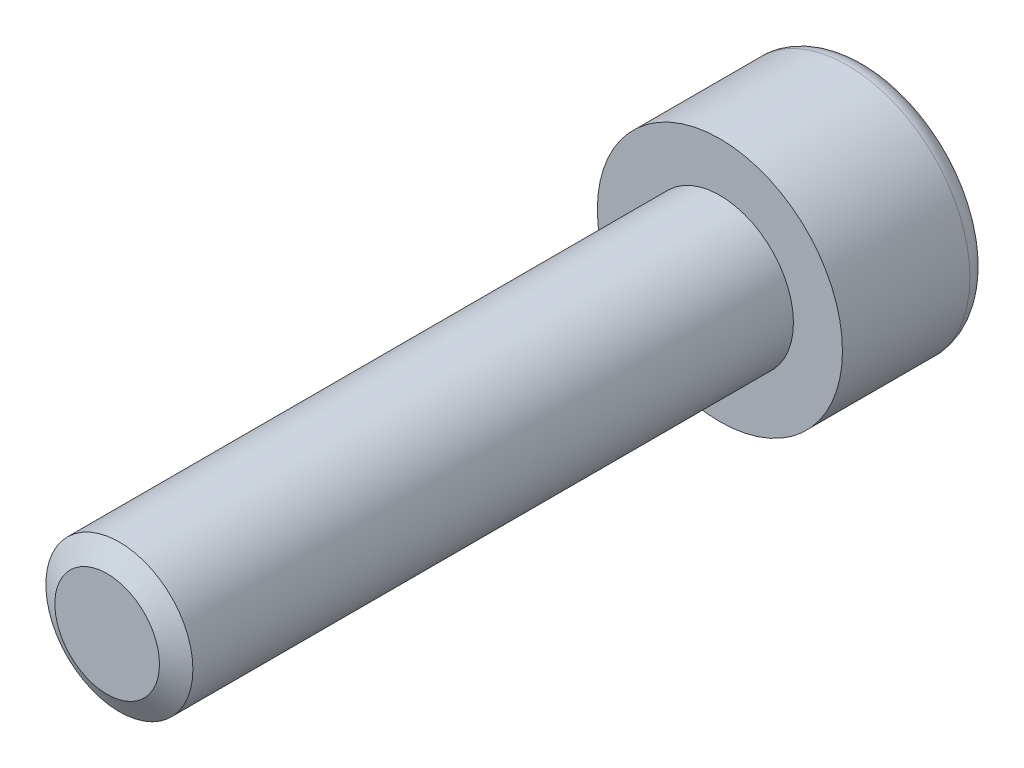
ISO-10303-21;
HEADER;
FILE_DESCRIPTION(('STEP AP214'),'2;1');
FILE_NAME('part.step','',(''),(''),'','','');
FILE_SCHEMA(('AUTOMOTIVE_DESIGN { 1 0 10303 214 1 1 1 1 }'));
ENDSEC;
DATA;
#1=APPLICATION_CONTEXT('core data for automotive mechanical design processes');
#2=APPLICATION_PROTOCOL_DEFINITION('international standard','automotive_design',2000,#1);
#3=PRODUCT_CONTEXT('',#1,'mechanical');
#4=PRODUCT('Part','Part','',(#3));
#5=PRODUCT_RELATED_PRODUCT_CATEGORY('part','',(#4));
#6=PRODUCT_DEFINITION_FORMATION('','',#4);
#7=PRODUCT_DEFINITION_CONTEXT('part definition',#1,'design');
#8=PRODUCT_DEFINITION('design','',#6,#7);
#9=PRODUCT_DEFINITION_SHAPE('','',#8);
#10=(LENGTH_UNIT() NAMED_UNIT(*) SI_UNIT(.MILLI.,.METRE.));
#11=(NAMED_UNIT(*) PLANE_ANGLE_UNIT() SI_UNIT($,.RADIAN.));
#12=(NAMED_UNIT(*) SI_UNIT($,.STERADIAN.) SOLID_ANGLE_UNIT());
#13=UNCERTAINTY_MEASURE_WITH_UNIT(LENGTH_MEASURE(1.E-05),#10,'distance_accuracy_value','');
#14=(GEOMETRIC_REPRESENTATION_CONTEXT(3) GLOBAL_UNCERTAINTY_ASSIGNED_CONTEXT((#13)) GLOBAL_UNIT_ASSIGNED_CONTEXT((#10,
#11,#12)) REPRESENTATION_CONTEXT('',''));
#15=CARTESIAN_POINT('',(0.,0.,0.));
#16=DIRECTION('',(0.,0.,1.));
#17=DIRECTION('',(1.,0.,0.));
#18=AXIS2_PLACEMENT_3D('',#15,#16,#17);
#19=CARTESIAN_POINT('',(0.,0.,-6.));
#20=DIRECTION('',(0.,0.,-1.));
#21=DIRECTION('',(-1.,0.,0.));
#22=AXIS2_PLACEMENT_3D('',#19,#20,#21);
#23=PLANE('',#22);
#24=CARTESIAN_POINT('',(0.,0.,-6.));
#25=DIRECTION('',(0.,0.,-1.));
#26=DIRECTION('',(-1.,0.,0.));
#27=AXIS2_PLACEMENT_3D('',#24,#25,#26);
#28=CIRCLE('',#27,4.2);
#29=CARTESIAN_POINT('',(-4.2,0.,-6.));
#30=VERTEX_POINT('',#29);
#31=EDGE_CURVE('E32',#30,#30,#28,.T.);
#32=ORIENTED_EDGE('',*,*,#31,.T.);
#33=EDGE_LOOP('',(#32));
#34=FACE_BOUND('',#33,.T.);
#35=CARTESIAN_POINT('',(0.,0.,-6.));
#36=DIRECTION('',(0.,0.,1.));
#37=DIRECTION('',(1.,0.,0.));
#38=AXIS2_PLACEMENT_3D('',#35,#36,#37);
#39=CIRCLE('',#38,2.88675134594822);
#40=CARTESIAN_POINT('',(-1.44337567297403,2.50000000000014,-6.));
#41=VERTEX_POINT('',#40);
#42=CARTESIAN_POINT('',(-2.88675134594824,0.,-6.));
#43=VERTEX_POINT('',#42);
#44=EDGE_CURVE('E45',#41,#43,#39,.T.);
#45=ORIENTED_EDGE('',*,*,#44,.T.);
#46=CARTESIAN_POINT('',(-1.44337567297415,-2.50000000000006,-6.));
#47=VERTEX_POINT('',#46);
#48=EDGE_CURVE('E122',#43,#47,#39,.T.);
#49=ORIENTED_EDGE('',*,*,#48,.T.);
#50=CARTESIAN_POINT('',(1.44337567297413,-2.50000000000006,-6.));
#51=VERTEX_POINT('',#50);
#52=EDGE_CURVE('E121',#47,#51,#39,.T.);
#53=ORIENTED_EDGE('',*,*,#52,.T.);
#54=CARTESIAN_POINT('',(2.88675134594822,0.,-6.));
#55=VERTEX_POINT('',#54);
#56=EDGE_CURVE('E90',#51,#55,#39,.T.);
#57=ORIENTED_EDGE('',*,*,#56,.T.);
#58=CARTESIAN_POINT('',(1.44337567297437,2.49999999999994,-6.));
#59=VERTEX_POINT('',#58);
#60=EDGE_CURVE('E80',#55,#59,#39,.T.);
#61=ORIENTED_EDGE('',*,*,#60,.T.);
#62=EDGE_CURVE('E38',#59,#41,#39,.T.);
#63=ORIENTED_EDGE('',*,*,#62,.T.);
#64=EDGE_LOOP('',(#45,#49,#53,#57,#61,#63));
#65=FACE_BOUND('',#64,.T.);
#66=ADVANCED_FACE('F24',(#34,#65),#23,.T.);
#67=CARTESIAN_POINT('',(0.,0.,25.));
#68=DIRECTION('',(0.,0.,-1.));
#69=DIRECTION('',(-1.,0.,0.));
#70=AXIS2_PLACEMENT_3D('',#67,#68,#69);
#71=CYLINDRICAL_SURFACE('',#70,3.);
#72=CARTESIAN_POINT('',(0.,0.,24.5));
#73=DIRECTION('',(0.,0.,1.));
#74=DIRECTION('',(1.,0.,0.));
#75=AXIS2_PLACEMENT_3D('',#72,#73,#74);
#76=CIRCLE('',#75,3.);
#77=CARTESIAN_POINT('',(2.99999999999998,0.,24.5));
#78=VERTEX_POINT('',#77);
#79=EDGE_CURVE('E100',#78,#78,#76,.F.);
#80=ORIENTED_EDGE('',*,*,#79,.T.);
#81=EDGE_LOOP('',(#80));
#82=FACE_BOUND('',#81,.T.);
#83=CARTESIAN_POINT('',(0.,0.,0.));
#84=DIRECTION('',(0.,0.,1.));
#85=DIRECTION('',(1.,0.,0.));
#86=AXIS2_PLACEMENT_3D('',#83,#84,#85);
#87=CIRCLE('',#86,3.);
#88=CARTESIAN_POINT('',(3.,0.,0.));
#89=VERTEX_POINT('',#88);
#90=EDGE_CURVE('E218',#89,#89,#87,.T.);
#91=ORIENTED_EDGE('',*,*,#90,.T.);
#92=EDGE_LOOP('',(#91));
#93=FACE_BOUND('',#92,.T.);
#94=ADVANCED_FACE('F26',(#82,#93),#71,.T.);
#95=CARTESIAN_POINT('',(0.,0.,25.));
#96=DIRECTION('',(0.,0.,1.));
#97=DIRECTION('',(1.,0.,0.));
#98=AXIS2_PLACEMENT_3D('',#95,#96,#97);
#99=PLANE('',#98);
#100=CARTESIAN_POINT('',(0.,0.,25.));
#101=DIRECTION('',(0.,0.,1.));
#102=DIRECTION('',(1.,0.,0.));
#103=AXIS2_PLACEMENT_3D('',#100,#101,#102);
#104=CIRCLE('',#103,2.13397459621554);
#105=CARTESIAN_POINT('',(2.13397459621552,0.,25.));
#106=VERTEX_POINT('',#105);
#107=EDGE_CURVE('E216',#106,#106,#104,.T.);
#108=ORIENTED_EDGE('',*,*,#107,.T.);
#109=EDGE_LOOP('',(#108));
#110=FACE_BOUND('',#109,.T.);
#111=ADVANCED_FACE('F197',(#110),#99,.T.);
#112=CARTESIAN_POINT('',(0.,0.,25.));
#113=DIRECTION('',(0.,0.,-1.));
#114=DIRECTION('',(-1.,0.,0.));
#115=AXIS2_PLACEMENT_3D('',#112,#113,#114);
#116=CONICAL_SURFACE('',#115,2.13397459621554,1.0471975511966);
#117=ORIENTED_EDGE('',*,*,#79,.F.);
#118=EDGE_LOOP('',(#117));
#119=FACE_BOUND('',#118,.T.);
#120=ORIENTED_EDGE('',*,*,#107,.F.);
#121=EDGE_LOOP('',(#120));
#122=FACE_BOUND('',#121,.T.);
#123=ADVANCED_FACE('F206',(#119,#122),#116,.T.);
#124=CARTESIAN_POINT('',(0.,0.,-6.));
#125=DIRECTION('',(0.,0.,1.));
#126=DIRECTION('',(1.,0.,0.));
#127=AXIS2_PLACEMENT_3D('',#124,#125,#126);
#128=CYLINDRICAL_SURFACE('',#127,5.);
#129=CARTESIAN_POINT('',(0.,0.,-5.2));
#130=DIRECTION('',(0.,0.,-1.));
#131=DIRECTION('',(-1.,0.,0.));
#132=AXIS2_PLACEMENT_3D('',#129,#130,#131);
#133=CIRCLE('',#132,5.);
#134=CARTESIAN_POINT('',(-5.,0.,-5.2));
#135=VERTEX_POINT('',#134);
#136=EDGE_CURVE('E11',#135,#135,#133,.F.);
#137=ORIENTED_EDGE('',*,*,#136,.T.);
#138=EDGE_LOOP('',(#137));
#139=FACE_BOUND('',#138,.T.);
#140=CARTESIAN_POINT('',(0.,0.,0.));
#141=DIRECTION('',(0.,0.,-1.));
#142=DIRECTION('',(-1.,0.,0.));
#143=AXIS2_PLACEMENT_3D('',#140,#141,#142);
#144=CIRCLE('',#143,5.);
#145=CARTESIAN_POINT('',(-5.,0.,0.));
#146=VERTEX_POINT('',#145);
#147=EDGE_CURVE('E222',#146,#146,#144,.T.);
#148=ORIENTED_EDGE('',*,*,#147,.T.);
#149=EDGE_LOOP('',(#148));
#150=FACE_BOUND('',#149,.T.);
#151=ADVANCED_FACE('F203',(#139,#150),#128,.T.);
#152=CARTESIAN_POINT('',(0.,0.,0.));
#153=DIRECTION('',(0.,0.,-1.));
#154=DIRECTION('',(-1.,0.,0.));
#155=AXIS2_PLACEMENT_3D('',#152,#153,#154);
#156=PLANE('',#155);
#157=ORIENTED_EDGE('',*,*,#90,.F.);
#158=EDGE_LOOP('',(#157));
#159=FACE_BOUND('',#158,.T.);
#160=ORIENTED_EDGE('',*,*,#147,.F.);
#161=EDGE_LOOP('',(#160));
#162=FACE_BOUND('',#161,.T.);
#163=ADVANCED_FACE('F202',(#159,#162),#156,.F.);
#164=CARTESIAN_POINT('',(0.,0.,-6.));
#165=DIRECTION('',(0.,0.,-1.));
#166=DIRECTION('',(-1.,0.,0.));
#167=AXIS2_PLACEMENT_3D('',#164,#165,#166);
#168=CONICAL_SURFACE('',#167,2.88675134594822,1.23732315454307);
#169=CARTESIAN_POINT('',(1.44326020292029,-2.50020000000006,-6.0000400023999));
#170=CARTESIAN_POINT('',(1.50307703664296,-2.3965942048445,-5.97930932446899));
#171=CARTESIAN_POINT('',(1.56307309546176,-2.29267798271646,-5.9604588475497));
#172=CARTESIAN_POINT('',(1.68341879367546,-2.08423311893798,-5.92730365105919));
#173=CARTESIAN_POINT('',(1.74376865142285,-1.97970409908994,-5.91300212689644));
#174=CARTESIAN_POINT('',(1.86421417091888,-1.77108633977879,-5.8898611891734));
#175=CARTESIAN_POINT('',(1.92430757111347,-1.66700151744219,-5.88097596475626));
#176=CARTESIAN_POINT('',(2.04462185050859,-1.4586110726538,-5.86905905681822));
#177=CARTESIAN_POINT('',(2.10484267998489,-1.35430553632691,-5.86602540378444));
#178=CARTESIAN_POINT('',(2.22528433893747,-1.14569446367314,-5.86602540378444));
#179=CARTESIAN_POINT('',(2.28550516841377,-1.04138892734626,-5.86905905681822));
#180=CARTESIAN_POINT('',(2.40581944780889,-0.832998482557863,-5.88097596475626));
#181=CARTESIAN_POINT('',(2.46591284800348,-0.728913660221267,-5.8898611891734));
#182=CARTESIAN_POINT('',(2.58635836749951,-0.520295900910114,-5.91300212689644));
#183=CARTESIAN_POINT('',(2.6467082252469,-0.415766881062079,-5.92730365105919));
#184=CARTESIAN_POINT('',(2.7670539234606,-0.207322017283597,-5.9604588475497));
#185=CARTESIAN_POINT('',(2.82704998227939,-0.103405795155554,-5.97930932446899));
#186=CARTESIAN_POINT('',(2.88686681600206,0.00020000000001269,-6.0000400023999));
#187=B_SPLINE_CURVE_WITH_KNOTS('',3,(#169,#170,#171,#172,#173,#174,#175,#176,#177,#178,#179,
#180,#181,#182,#183,#184,#185,#186),.UNSPECIFIED.,.F.,.F.,(4,2,2,2,2,2,2,2,4),(0.,
0.364283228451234,0.728821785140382,1.09023268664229,1.45152192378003,1.81281116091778,
2.17422206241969,2.53876061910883,2.90304384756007),.UNSPECIFIED.);
#188=EDGE_CURVE('E94',#51,#55,#187,.T.);
#189=ORIENTED_EDGE('',*,*,#188,.T.);
#190=ORIENTED_EDGE('',*,*,#56,.F.);
#191=EDGE_LOOP('',(#189,#190));
#192=FACE_BOUND('',#191,.T.);
#193=ADVANCED_FACE('F95',(#192),#168,.F.);
#194=CARTESIAN_POINT('',(-3.74214401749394,-2.50000000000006,-6.55898589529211));
#195=CARTESIAN_POINT('',(-3.62969526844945,-2.50000000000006,-6.52660458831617));
#196=CARTESIAN_POINT('',(-3.51712953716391,-2.50000000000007,-6.49462272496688));
#197=CARTESIAN_POINT('',(-3.29170495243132,-2.50000000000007,-6.43167651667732));
#198=CARTESIAN_POINT('',(-3.17884607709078,-2.50000000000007,-6.40071225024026));
#199=CARTESIAN_POINT('',(-2.95258941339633,-2.50000000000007,-6.33997017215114));
#200=CARTESIAN_POINT('',(-2.83919102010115,-2.50000000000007,-6.31019460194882));
#201=CARTESIAN_POINT('',(-2.61199972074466,-2.50000000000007,-6.25219835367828));
#202=CARTESIAN_POINT('',(-2.49820682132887,-2.50000000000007,-6.22397764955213));
#203=CARTESIAN_POINT('',(-2.15931860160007,-2.50000000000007,-6.14294166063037));
#204=CARTESIAN_POINT('',(-1.93355036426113,-2.50000000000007,-6.0928838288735));
#205=CARTESIAN_POINT('',(-1.47974581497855,-2.50000000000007,-6.00427398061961));
#206=CARTESIAN_POINT('',(-1.25171048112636,-2.50000000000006,-5.9657172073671));
#207=CARTESIAN_POINT('',(-0.915512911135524,-2.50000000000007,-5.92163126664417));
#208=CARTESIAN_POINT('',(-0.80822425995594,-2.50000000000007,-5.90945086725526));
#209=CARTESIAN_POINT('',(-0.593253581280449,-2.50000000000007,-5.88935340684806));
#210=CARTESIAN_POINT('',(-0.485571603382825,-2.50000000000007,-5.88143582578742));
#211=CARTESIAN_POINT('',(-0.270027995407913,-2.50000000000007,-5.87028095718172));
#212=CARTESIAN_POINT('',(-0.162166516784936,-2.50000000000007,-5.86704079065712));
#213=CARTESIAN_POINT('',(0.0535937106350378,-2.50000000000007,-5.86541831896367));
#214=CARTESIAN_POINT('',(0.161492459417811,-2.50000000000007,-5.86703601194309));
#215=CARTESIAN_POINT('',(0.37778532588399,-2.50000000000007,-5.87505996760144));
#216=CARTESIAN_POINT('',(0.486178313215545,-2.50000000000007,-5.88149616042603));
#217=CARTESIAN_POINT('',(0.702607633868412,-2.50000000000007,-5.89883679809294));
#218=CARTESIAN_POINT('',(0.810643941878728,-2.50000000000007,-5.90974155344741));
#219=CARTESIAN_POINT('',(1.02633546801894,-2.50000000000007,-5.93550617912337));
#220=CARTESIAN_POINT('',(1.13399025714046,-2.50000000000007,-5.95036959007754));
#221=CARTESIAN_POINT('',(1.34877490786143,-2.50000000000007,-5.98345944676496));
#222=CARTESIAN_POINT('',(1.45590477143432,-2.50000000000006,-6.0016858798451));
#223=CARTESIAN_POINT('',(1.68753741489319,-2.50000000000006,-6.04421721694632));
#224=CARTESIAN_POINT('',(1.81194646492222,-2.50000000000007,-6.06902890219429));
#225=CARTESIAN_POINT('',(2.06012776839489,-2.50000000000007,-6.12166849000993));
#226=CARTESIAN_POINT('',(2.18389997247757,-2.50000000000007,-6.14949662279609));
#227=CARTESIAN_POINT('',(2.43091931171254,-2.50000000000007,-6.20753261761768));
#228=CARTESIAN_POINT('',(2.55416628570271,-2.50000000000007,-6.23774116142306));
#229=CARTESIAN_POINT('',(2.80018730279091,-2.50000000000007,-6.30003193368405));
#230=CARTESIAN_POINT('',(2.9229613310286,-2.50000000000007,-6.3321142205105));
#231=CARTESIAN_POINT('',(3.29092574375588,-2.50000000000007,-6.43062684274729));
#232=CARTESIAN_POINT('',(3.53552350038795,-2.50000000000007,-6.49926603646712));
#233=CARTESIAN_POINT('',(4.02363195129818,-2.50000000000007,-6.64030395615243));
#234=CARTESIAN_POINT('',(4.26714259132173,-2.50000000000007,-6.71270286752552));
#235=CARTESIAN_POINT('',(4.74885074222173,-2.50000000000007,-6.85865200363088));
#236=CARTESIAN_POINT('',(4.98706247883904,-2.50000000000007,-6.93215540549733));
#237=CARTESIAN_POINT('',(5.46296455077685,-2.50000000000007,-7.08086936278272));
#238=CARTESIAN_POINT('',(5.70065485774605,-2.50000000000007,-7.15608000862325));
#239=CARTESIAN_POINT('',(6.17486752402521,-2.50000000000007,-7.30747953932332));
#240=CARTESIAN_POINT('',(6.41139116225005,-2.50000000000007,-7.38366442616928));
#241=CARTESIAN_POINT('',(6.88412079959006,-2.50000000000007,-7.53695307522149));
#242=CARTESIAN_POINT('',(7.12032682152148,-2.50000000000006,-7.61405676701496));
#243=CARTESIAN_POINT('',(7.3564280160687,-2.50000000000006,-7.69147617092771));
#244=B_SPLINE_CURVE_WITH_KNOTS('',3,(#194,#195,#196,#197,#198,#199,#200,#201,#202,#203,#204,
#205,#206,#207,#208,#209,#210,#211,#212,#213,#214,#215,#216,#217,#218,#219,#220,#221,#222,#223,
#224,#225,#226,#227,#228,#229,#230,#231,#232,#233,#234,#235,#236,#237,#238,#239,#240,#241,#242,
#243),.UNSPECIFIED.,.F.,.F.,(4,2,2,2,2,2,2,2,2,2,2,2,2,2,2,2,2,2,2,2,2,2,2,2,4),(0.,
0.35105669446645,0.702140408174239,1.05385756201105,1.40556881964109,2.09915406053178,
2.7924520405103,3.11631440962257,3.44013726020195,3.76376071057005,4.08738403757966,
4.41303440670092,4.73870740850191,5.06467267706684,5.3906367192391,5.77116505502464,
6.15172245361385,6.53238924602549,6.91306790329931,7.67515023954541,8.43727019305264,
9.18514321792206,9.93305594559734,10.6785255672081,11.4239384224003),.UNSPECIFIED.);
#245=EDGE_CURVE('E88',#47,#51,#244,.T.);
#246=ORIENTED_EDGE('',*,*,#245,.T.);
#247=ORIENTED_EDGE('',*,*,#52,.F.);
#248=EDGE_LOOP('',(#246,#247));
#249=FACE_BOUND('',#248,.T.);
#250=ADVANCED_FACE('F311',(#249),#168,.F.);
#251=CARTESIAN_POINT('',(-2.88686681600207,0.000200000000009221,-6.0000400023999));
#252=CARTESIAN_POINT('',(-2.82704998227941,-0.103405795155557,-5.97930932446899));
#253=CARTESIAN_POINT('',(-2.76705392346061,-0.2073220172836,-5.96045884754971));
#254=CARTESIAN_POINT('',(-2.64670822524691,-0.415766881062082,-5.92730365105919));
#255=CARTESIAN_POINT('',(-2.58635836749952,-0.520295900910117,-5.91300212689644));
#256=CARTESIAN_POINT('',(-2.46591284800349,-0.728913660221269,-5.8898611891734));
#257=CARTESIAN_POINT('',(-2.40581944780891,-0.832998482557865,-5.88097596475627));
#258=CARTESIAN_POINT('',(-2.28550516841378,-1.04138892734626,-5.86905905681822));
#259=CARTESIAN_POINT('',(-2.22528433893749,-1.14569446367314,-5.86602540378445));
#260=CARTESIAN_POINT('',(-2.1048426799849,-1.35430553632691,-5.86602540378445));
#261=CARTESIAN_POINT('',(-2.0446218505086,-1.4586110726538,-5.86905905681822));
#262=CARTESIAN_POINT('',(-1.92430757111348,-1.66700151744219,-5.88097596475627));
#263=CARTESIAN_POINT('',(-1.86421417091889,-1.77108633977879,-5.8898611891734));
#264=CARTESIAN_POINT('',(-1.74376865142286,-1.97970409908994,-5.91300212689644));
#265=CARTESIAN_POINT('',(-1.68341879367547,-2.08423311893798,-5.92730365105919));
#266=CARTESIAN_POINT('',(-1.56307309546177,-2.29267798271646,-5.96045884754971));
#267=CARTESIAN_POINT('',(-1.50307703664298,-2.3965942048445,-5.97930932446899));
#268=CARTESIAN_POINT('',(-1.44326020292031,-2.50020000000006,-6.0000400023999));
#269=B_SPLINE_CURVE_WITH_KNOTS('',3,(#251,#252,#253,#254,#255,#256,#257,#258,#259,#260,#261,
#262,#263,#264,#265,#266,#267,#268),.UNSPECIFIED.,.F.,.F.,(4,2,2,2,2,2,2,2,4),(0.,
0.364283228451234,0.728821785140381,1.09023268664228,1.45152192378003,1.81281116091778,
2.17422206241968,2.53876061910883,2.90304384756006),.UNSPECIFIED.);
#270=EDGE_CURVE('E130',#43,#47,#269,.T.);
#271=ORIENTED_EDGE('',*,*,#270,.T.);
#272=ORIENTED_EDGE('',*,*,#48,.F.);
#273=EDGE_LOOP('',(#271,#272));
#274=FACE_BOUND('',#273,.T.);
#275=ADVANCED_FACE('F304',(#274),#168,.F.);
#276=CARTESIAN_POINT('',(-1.44326020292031,2.50019999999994,-6.00004000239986));
#277=CARTESIAN_POINT('',(-1.50307703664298,2.39659420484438,-5.97930932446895));
#278=CARTESIAN_POINT('',(-1.56307309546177,2.29267798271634,-5.96045884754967));
#279=CARTESIAN_POINT('',(-1.68341879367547,2.08423311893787,-5.92730365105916));
#280=CARTESIAN_POINT('',(-1.74376865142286,1.97970409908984,-5.91300212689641));
#281=CARTESIAN_POINT('',(-1.86421417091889,1.7710863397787,-5.88986118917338));
#282=CARTESIAN_POINT('',(-1.92430757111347,1.66700151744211,-5.88097596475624));
#283=CARTESIAN_POINT('',(-2.0446218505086,1.45861107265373,-5.8690590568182));
#284=CARTESIAN_POINT('',(-2.10484267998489,1.35430553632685,-5.86602540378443));
#285=CARTESIAN_POINT('',(-2.22528433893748,1.14569446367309,-5.86602540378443));
#286=CARTESIAN_POINT('',(-2.28550516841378,1.04138892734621,-5.86905905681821));
#287=CARTESIAN_POINT('',(-2.4058194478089,0.832998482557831,-5.88097596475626));
#288=CARTESIAN_POINT('',(-2.46591284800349,0.728913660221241,-5.8898611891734));
#289=CARTESIAN_POINT('',(-2.58635836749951,0.520295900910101,-5.91300212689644));
#290=CARTESIAN_POINT('',(-2.6467082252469,0.415766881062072,-5.92730365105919));
#291=CARTESIAN_POINT('',(-2.7670539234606,0.207322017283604,-5.9604588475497));
#292=CARTESIAN_POINT('',(-2.8270499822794,0.103405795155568,-5.97930932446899));
#293=CARTESIAN_POINT('',(-2.88686681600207,-0.000199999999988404,-6.0000400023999));
#294=B_SPLINE_CURVE_WITH_KNOTS('',3,(#276,#277,#278,#279,#280,#281,#282,#283,#284,#285,#286,
#287,#288,#289,#290,#291,#292,#293),.UNSPECIFIED.,.F.,.F.,(4,2,2,2,2,2,2,2,4),(0.,
0.364283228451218,0.728821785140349,1.09023268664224,1.45152192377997,1.8128111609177,
2.17422206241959,2.53876061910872,2.90304384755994),.UNSPECIFIED.);
#295=EDGE_CURVE('E157',#41,#43,#294,.T.);
#296=ORIENTED_EDGE('',*,*,#295,.T.);
#297=ORIENTED_EDGE('',*,*,#44,.F.);
#298=EDGE_LOOP('',(#296,#297));
#299=FACE_BOUND('',#298,.T.);
#300=ADVANCED_FACE('F305',(#299),#168,.F.);
#301=CARTESIAN_POINT('',(-3.74214401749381,2.49999999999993,-6.55898589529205));
#302=CARTESIAN_POINT('',(-3.62969526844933,2.49999999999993,-6.52660458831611));
#303=CARTESIAN_POINT('',(-3.5171295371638,2.49999999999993,-6.49462272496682));
#304=CARTESIAN_POINT('',(-3.29170495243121,2.49999999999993,-6.43167651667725));
#305=CARTESIAN_POINT('',(-3.17884607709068,2.49999999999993,-6.4007122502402));
#306=CARTESIAN_POINT('',(-2.95258941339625,2.49999999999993,-6.33997017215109));
#307=CARTESIAN_POINT('',(-2.83919102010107,2.49999999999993,-6.31019460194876));
#308=CARTESIAN_POINT('',(-2.6119997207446,2.49999999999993,-6.25219835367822));
#309=CARTESIAN_POINT('',(-2.49820682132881,2.49999999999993,-6.22397764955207));
#310=CARTESIAN_POINT('',(-2.15931860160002,2.49999999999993,-6.14294166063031));
#311=CARTESIAN_POINT('',(-1.9335503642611,2.49999999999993,-6.09288382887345));
#312=CARTESIAN_POINT('',(-1.47974581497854,2.49999999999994,-6.00427398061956));
#313=CARTESIAN_POINT('',(-1.25171048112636,2.49999999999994,-5.96571720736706));
#314=CARTESIAN_POINT('',(-0.915512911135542,2.49999999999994,-5.92163126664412));
#315=CARTESIAN_POINT('',(-0.808224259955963,2.49999999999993,-5.90945086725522));
#316=CARTESIAN_POINT('',(-0.593253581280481,2.49999999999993,-5.889353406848));
#317=CARTESIAN_POINT('',(-0.48557160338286,2.49999999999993,-5.88143582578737));
#318=CARTESIAN_POINT('',(-0.270027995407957,2.49999999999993,-5.87028095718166));
#319=CARTESIAN_POINT('',(-0.162166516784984,2.49999999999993,-5.86704079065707));
#320=CARTESIAN_POINT('',(0.0535937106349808,2.49999999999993,-5.86541831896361));
#321=CARTESIAN_POINT('',(0.16149245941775,2.49999999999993,-5.86703601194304));
#322=CARTESIAN_POINT('',(0.37778532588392,2.49999999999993,-5.87505996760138));
#323=CARTESIAN_POINT('',(0.486178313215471,2.49999999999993,-5.88149616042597));
#324=CARTESIAN_POINT('',(0.702607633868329,2.49999999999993,-5.89883679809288));
#325=CARTESIAN_POINT('',(0.81064394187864,2.49999999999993,-5.90974155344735));
#326=CARTESIAN_POINT('',(1.02633546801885,2.49999999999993,-5.9355061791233));
#327=CARTESIAN_POINT('',(1.13399025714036,2.49999999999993,-5.95036959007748));
#328=CARTESIAN_POINT('',(1.34877490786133,2.49999999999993,-5.98345944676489));
#329=CARTESIAN_POINT('',(1.45590477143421,2.49999999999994,-6.00168587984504));
#330=CARTESIAN_POINT('',(1.68753741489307,2.49999999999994,-6.04421721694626));
#331=CARTESIAN_POINT('',(1.8119464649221,2.49999999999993,-6.06902890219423));
#332=CARTESIAN_POINT('',(2.06012776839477,2.49999999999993,-6.12166849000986));
#333=CARTESIAN_POINT('',(2.18389997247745,2.49999999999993,-6.14949662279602));
#334=CARTESIAN_POINT('',(2.43091931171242,2.49999999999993,-6.20753261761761));
#335=CARTESIAN_POINT('',(2.55416628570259,2.49999999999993,-6.23774116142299));
#336=CARTESIAN_POINT('',(2.8001873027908,2.49999999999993,-6.30003193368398));
#337=CARTESIAN_POINT('',(2.92296133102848,2.49999999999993,-6.33211422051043));
#338=CARTESIAN_POINT('',(3.29092574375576,2.49999999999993,-6.43062684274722));
#339=CARTESIAN_POINT('',(3.53552350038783,2.49999999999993,-6.49926603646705));
#340=CARTESIAN_POINT('',(4.02363195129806,2.49999999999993,-6.64030395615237));
#341=CARTESIAN_POINT('',(4.2671425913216,2.49999999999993,-6.71270286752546));
#342=CARTESIAN_POINT('',(4.74885074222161,2.49999999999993,-6.85865200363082));
#343=CARTESIAN_POINT('',(4.98706247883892,2.49999999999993,-6.93215540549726));
#344=CARTESIAN_POINT('',(5.46296455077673,2.49999999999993,-7.08086936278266));
#345=CARTESIAN_POINT('',(5.70065485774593,2.49999999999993,-7.15608000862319));
#346=CARTESIAN_POINT('',(6.17486752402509,2.49999999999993,-7.30747953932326));
#347=CARTESIAN_POINT('',(6.41139116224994,2.49999999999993,-7.38366442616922));
#348=CARTESIAN_POINT('',(6.88412079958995,2.49999999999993,-7.53695307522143));
#349=CARTESIAN_POINT('',(7.12032682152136,2.49999999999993,-7.6140567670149));
#350=CARTESIAN_POINT('',(7.35642801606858,2.49999999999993,-7.69147617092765));
#351=B_SPLINE_CURVE_WITH_KNOTS('',3,(#301,#302,#303,#304,#305,#306,#307,#308,#309,#310,#311,
#312,#313,#314,#315,#316,#317,#318,#319,#320,#321,#322,#323,#324,#325,#326,#327,#328,#329,#330,
#331,#332,#333,#334,#335,#336,#337,#338,#339,#340,#341,#342,#343,#344,#345,#346,#347,#348,#349,
#350),.UNSPECIFIED.,.F.,.F.,(4,2,2,2,2,2,2,2,2,2,2,2,2,2,2,2,2,2,2,2,2,2,2,2,4),(0.,
0.351056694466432,0.702140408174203,1.053857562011,1.40556881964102,2.09915406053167,
2.79245204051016,3.11631440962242,3.44013726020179,3.76376071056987,4.08738403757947,
4.41303440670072,4.73870740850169,5.06467267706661,5.39063671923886,5.7711650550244,
6.1517224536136,6.53238924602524,6.91306790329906,7.67515023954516,8.43727019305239,
9.18514321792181,9.9330559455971,10.6785255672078,11.4239384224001),.UNSPECIFIED.);
#352=EDGE_CURVE('E112',#59,#41,#351,.F.);
#353=ORIENTED_EDGE('',*,*,#352,.T.);
#354=ORIENTED_EDGE('',*,*,#62,.F.);
#355=EDGE_LOOP('',(#353,#354));
#356=FACE_BOUND('',#355,.T.);
#357=ADVANCED_FACE('F144',(#356),#168,.F.);
#358=CARTESIAN_POINT('',(2.88686681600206,-0.000199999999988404,-6.0000400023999));
#359=CARTESIAN_POINT('',(2.82704998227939,0.103405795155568,-5.97930932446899));
#360=CARTESIAN_POINT('',(2.76705392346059,0.207322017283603,-5.9604588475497));
#361=CARTESIAN_POINT('',(2.64670822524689,0.415766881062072,-5.92730365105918));
#362=CARTESIAN_POINT('',(2.5863583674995,0.520295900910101,-5.91300212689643));
#363=CARTESIAN_POINT('',(2.46591284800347,0.728913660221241,-5.88986118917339));
#364=CARTESIAN_POINT('',(2.40581944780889,0.832998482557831,-5.88097596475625));
#365=CARTESIAN_POINT('',(2.28550516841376,1.04138892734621,-5.8690590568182));
#366=CARTESIAN_POINT('',(2.22528433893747,1.14569446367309,-5.86602540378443));
#367=CARTESIAN_POINT('',(2.10484267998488,1.35430553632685,-5.86602540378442));
#368=CARTESIAN_POINT('',(2.04462185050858,1.45861107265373,-5.8690590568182));
#369=CARTESIAN_POINT('',(1.92430757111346,1.66700151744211,-5.88097596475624));
#370=CARTESIAN_POINT('',(1.86421417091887,1.7710863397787,-5.88986118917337));
#371=CARTESIAN_POINT('',(1.74376865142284,1.97970409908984,-5.9130021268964));
#372=CARTESIAN_POINT('',(1.68341879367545,2.08423311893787,-5.92730365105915));
#373=CARTESIAN_POINT('',(1.56307309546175,2.29267798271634,-5.96045884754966));
#374=CARTESIAN_POINT('',(1.50307703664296,2.39659420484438,-5.97930932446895));
#375=CARTESIAN_POINT('',(1.44326020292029,2.50019999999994,-6.00004000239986));
#376=B_SPLINE_CURVE_WITH_KNOTS('',3,(#358,#359,#360,#361,#362,#363,#364,#365,#366,#367,#368,
#369,#370,#371,#372,#373,#374,#375),.UNSPECIFIED.,.F.,.F.,(4,2,2,2,2,2,2,2,4),(0.,
0.364283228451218,0.728821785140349,1.09023268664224,1.45152192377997,1.8128111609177,
2.17422206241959,2.53876061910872,2.90304384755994),.UNSPECIFIED.);
#377=EDGE_CURVE('E84',#55,#59,#376,.T.);
#378=ORIENTED_EDGE('',*,*,#377,.T.);
#379=ORIENTED_EDGE('',*,*,#60,.F.);
#380=EDGE_LOOP('',(#378,#379));
#381=FACE_BOUND('',#380,.T.);
#382=ADVANCED_FACE('F82',(#381),#168,.F.);
#383=CARTESIAN_POINT('',(0.,0.,-2.));
#384=DIRECTION('',(0.,0.,-1.));
#385=DIRECTION('',(-1.,0.,0.));
#386=AXIS2_PLACEMENT_3D('',#383,#384,#385);
#387=CONICAL_SURFACE('',#386,2.88675134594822,1.23732315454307);
#388=CARTESIAN_POINT('',(0.,0.,-1.));
#389=VERTEX_POINT('',#388);
#390=VERTEX_LOOP('',#389);
#391=FACE_BOUND('',#390,.T.);
#392=CARTESIAN_POINT('',(0.,0.,-2.));
#393=DIRECTION('',(0.,0.,1.));
#394=DIRECTION('',(1.,0.,0.));
#395=AXIS2_PLACEMENT_3D('',#392,#393,#394);
#396=CIRCLE('',#395,2.88675134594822);
#397=CARTESIAN_POINT('',(2.88675134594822,0.,-2.));
#398=VERTEX_POINT('',#397);
#399=CARTESIAN_POINT('',(1.44337567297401,2.50000000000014,-2.));
#400=VERTEX_POINT('',#399);
#401=EDGE_CURVE('E247',#398,#400,#396,.T.);
#402=ORIENTED_EDGE('',*,*,#401,.F.);
#403=CARTESIAN_POINT('',(1.44337567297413,-2.50000000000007,-2.));
#404=VERTEX_POINT('',#403);
#405=EDGE_CURVE('E111',#404,#398,#396,.T.);
#406=ORIENTED_EDGE('',*,*,#405,.F.);
#407=CARTESIAN_POINT('',(-1.44337567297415,-2.50000000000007,-2.));
#408=VERTEX_POINT('',#407);
#409=EDGE_CURVE('E254',#408,#404,#396,.T.);
#410=ORIENTED_EDGE('',*,*,#409,.F.);
#411=CARTESIAN_POINT('',(-2.88675134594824,0.,-2.));
#412=VERTEX_POINT('',#411);
#413=EDGE_CURVE('E258',#412,#408,#396,.T.);
#414=ORIENTED_EDGE('',*,*,#413,.F.);
#415=CARTESIAN_POINT('',(-1.44337567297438,2.49999999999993,-2.));
#416=VERTEX_POINT('',#415);
#417=EDGE_CURVE('E252',#416,#412,#396,.T.);
#418=ORIENTED_EDGE('',*,*,#417,.F.);
#419=EDGE_CURVE('E249',#400,#416,#396,.T.);
#420=ORIENTED_EDGE('',*,*,#419,.F.);
#421=EDGE_LOOP('',(#402,#406,#410,#414,#418,#420));
#422=FACE_BOUND('',#421,.T.);
#423=ADVANCED_FACE('F143',(#391,#422),#387,.F.);
#424=CARTESIAN_POINT('',(-2.88675134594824,0.,-2.));
#425=DIRECTION('',(0.,0.,1.));
#426=DIRECTION('',(1.,0.,0.));
#427=AXIS2_PLACEMENT_3D('',#424,#425,#426);
#428=PLANE('',#427);
#429=DIRECTION('',(0.500000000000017,-0.866025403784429,0.));
#430=VECTOR('',#429,1.);
#431=CARTESIAN_POINT('',(2.88675134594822,0.,-2.));
#432=LINE('',#431,#430);
#433=EDGE_CURVE('E245',#400,#398,#432,.T.);
#434=ORIENTED_EDGE('',*,*,#433,.T.);
#435=ORIENTED_EDGE('',*,*,#401,.T.);
#436=EDGE_LOOP('',(#434,#435));
#437=FACE_BOUND('',#436,.T.);
#438=ADVANCED_FACE('F146',(#437),#428,.T.);
#439=DIRECTION('',(1.,0.,0.));
#440=VECTOR('',#439,1.);
#441=CARTESIAN_POINT('',(1.44337567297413,2.49999999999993,-2.));
#442=LINE('',#441,#440);
#443=EDGE_CURVE('E117',#416,#400,#442,.T.);
#444=ORIENTED_EDGE('',*,*,#443,.T.);
#445=ORIENTED_EDGE('',*,*,#419,.T.);
#446=EDGE_LOOP('',(#444,#445));
#447=FACE_BOUND('',#446,.T.);
#448=ADVANCED_FACE('F279',(#447),#428,.T.);
#449=DIRECTION('',(0.500000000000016,0.866025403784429,0.));
#450=VECTOR('',#449,1.);
#451=CARTESIAN_POINT('',(-1.44337567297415,2.49999999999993,-2.));
#452=LINE('',#451,#450);
#453=EDGE_CURVE('E238',#412,#416,#452,.T.);
#454=ORIENTED_EDGE('',*,*,#453,.T.);
#455=ORIENTED_EDGE('',*,*,#417,.T.);
#456=EDGE_LOOP('',(#454,#455));
#457=FACE_BOUND('',#456,.T.);
#458=ADVANCED_FACE('F269',(#457),#428,.T.);
#459=DIRECTION('',(-0.499999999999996,0.866025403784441,0.));
#460=VECTOR('',#459,1.);
#461=CARTESIAN_POINT('',(-2.88675134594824,0.,-2.));
#462=LINE('',#461,#460);
#463=EDGE_CURVE('E240',#408,#412,#462,.T.);
#464=ORIENTED_EDGE('',*,*,#463,.T.);
#465=ORIENTED_EDGE('',*,*,#413,.T.);
#466=EDGE_LOOP('',(#464,#465));
#467=FACE_BOUND('',#466,.T.);
#468=ADVANCED_FACE('F296',(#467),#428,.T.);
#469=DIRECTION('',(-1.,0.,0.));
#470=VECTOR('',#469,1.);
#471=CARTESIAN_POINT('',(-1.44337567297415,-2.50000000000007,-2.));
#472=LINE('',#471,#470);
#473=EDGE_CURVE('E242',#404,#408,#472,.T.);
#474=ORIENTED_EDGE('',*,*,#473,.T.);
#475=ORIENTED_EDGE('',*,*,#409,.T.);
#476=EDGE_LOOP('',(#474,#475));
#477=FACE_BOUND('',#476,.T.);
#478=ADVANCED_FACE('F290',(#477),#428,.T.);
#479=DIRECTION('',(-0.499999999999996,-0.866025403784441,0.));
#480=VECTOR('',#479,1.);
#481=CARTESIAN_POINT('',(1.44337567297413,-2.50000000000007,-2.));
#482=LINE('',#481,#480);
#483=EDGE_CURVE('E115',#398,#404,#482,.T.);
#484=ORIENTED_EDGE('',*,*,#483,.T.);
#485=ORIENTED_EDGE('',*,*,#405,.T.);
#486=EDGE_LOOP('',(#484,#485));
#487=FACE_BOUND('',#486,.T.);
#488=ADVANCED_FACE('F285',(#487),#428,.T.);
#489=CARTESIAN_POINT('',(1.44337567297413,-2.50000000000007,-2.));
#490=DIRECTION('',(0.866025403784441,-0.499999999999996,0.));
#491=DIRECTION('',(0.499999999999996,0.866025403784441,0.));
#492=AXIS2_PLACEMENT_3D('',#489,#490,#491);
#493=PLANE('',#492);
#494=ORIENTED_EDGE('',*,*,#188,.F.);
#495=DIRECTION('',(0.,0.,-1.));
#496=VECTOR('',#495,1.);
#497=CARTESIAN_POINT('',(1.44337567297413,-2.50000000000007,-2.));
#498=LINE('',#497,#496);
#499=EDGE_CURVE('E116',#404,#51,#498,.T.);
#500=ORIENTED_EDGE('',*,*,#499,.F.);
#501=ORIENTED_EDGE('',*,*,#483,.F.);
#502=DIRECTION('',(0.,0.,-1.));
#503=VECTOR('',#502,1.);
#504=CARTESIAN_POINT('',(2.88675134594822,0.,-2.));
#505=LINE('',#504,#503);
#506=EDGE_CURVE('E107',#398,#55,#505,.T.);
#507=ORIENTED_EDGE('',*,*,#506,.T.);
#508=EDGE_LOOP('',(#494,#500,#501,#507));
#509=FACE_BOUND('',#508,.T.);
#510=ADVANCED_FACE('F114',(#509),#493,.F.);
#511=CARTESIAN_POINT('',(-1.44337567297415,-2.50000000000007,-2.));
#512=DIRECTION('',(0.,-1.,0.));
#513=DIRECTION('',(0.,0.,-1.));
#514=AXIS2_PLACEMENT_3D('',#511,#512,#513);
#515=PLANE('',#514);
#516=ORIENTED_EDGE('',*,*,#245,.F.);
#517=DIRECTION('',(0.,0.,-1.));
#518=VECTOR('',#517,1.);
#519=CARTESIAN_POINT('',(-1.44337567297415,-2.50000000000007,-2.));
#520=LINE('',#519,#518);
#521=EDGE_CURVE('E228',#408,#47,#520,.T.);
#522=ORIENTED_EDGE('',*,*,#521,.F.);
#523=ORIENTED_EDGE('',*,*,#473,.F.);
#524=ORIENTED_EDGE('',*,*,#499,.T.);
#525=EDGE_LOOP('',(#516,#522,#523,#524));
#526=FACE_BOUND('',#525,.T.);
#527=ADVANCED_FACE('F136',(#526),#515,.F.);
#528=CARTESIAN_POINT('',(-2.88675134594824,0.,-2.));
#529=DIRECTION('',(-0.866025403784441,-0.499999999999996,0.));
#530=DIRECTION('',(0.499999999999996,-0.866025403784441,0.));
#531=AXIS2_PLACEMENT_3D('',#528,#529,#530);
#532=PLANE('',#531);
#533=ORIENTED_EDGE('',*,*,#270,.F.);
#534=DIRECTION('',(0.,0.,-1.));
#535=VECTOR('',#534,1.);
#536=CARTESIAN_POINT('',(-2.88675134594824,0.,-2.));
#537=LINE('',#536,#535);
#538=EDGE_CURVE('E231',#412,#43,#537,.T.);
#539=ORIENTED_EDGE('',*,*,#538,.F.);
#540=ORIENTED_EDGE('',*,*,#463,.F.);
#541=ORIENTED_EDGE('',*,*,#521,.T.);
#542=EDGE_LOOP('',(#533,#539,#540,#541));
#543=FACE_BOUND('',#542,.T.);
#544=ADVANCED_FACE('F179',(#543),#532,.F.);
#545=CARTESIAN_POINT('',(-1.44337567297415,2.49999999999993,-2.));
#546=DIRECTION('',(-0.866025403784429,0.500000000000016,0.));
#547=DIRECTION('',(-0.500000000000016,-0.866025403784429,0.));
#548=AXIS2_PLACEMENT_3D('',#545,#546,#547);
#549=PLANE('',#548);
#550=ORIENTED_EDGE('',*,*,#295,.F.);
#551=DIRECTION('',(0.,0.,-1.));
#552=VECTOR('',#551,1.);
#553=CARTESIAN_POINT('',(-1.44337567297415,2.49999999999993,-2.));
#554=LINE('',#553,#552);
#555=EDGE_CURVE('E233',#416,#41,#554,.T.);
#556=ORIENTED_EDGE('',*,*,#555,.F.);
#557=ORIENTED_EDGE('',*,*,#453,.F.);
#558=ORIENTED_EDGE('',*,*,#538,.T.);
#559=EDGE_LOOP('',(#550,#556,#557,#558));
#560=FACE_BOUND('',#559,.T.);
#561=ADVANCED_FACE('F175',(#560),#549,.F.);
#562=CARTESIAN_POINT('',(1.44337567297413,2.49999999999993,-2.));
#563=DIRECTION('',(0.,1.,0.));
#564=DIRECTION('',(0.,0.,1.));
#565=AXIS2_PLACEMENT_3D('',#562,#563,#564);
#566=PLANE('',#565);
#567=ORIENTED_EDGE('',*,*,#352,.F.);
#568=DIRECTION('',(0.,0.,-1.));
#569=VECTOR('',#568,1.);
#570=CARTESIAN_POINT('',(1.44337567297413,2.49999999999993,-2.));
#571=LINE('',#570,#569);
#572=EDGE_CURVE('E110',#400,#59,#571,.T.);
#573=ORIENTED_EDGE('',*,*,#572,.F.);
#574=ORIENTED_EDGE('',*,*,#443,.F.);
#575=ORIENTED_EDGE('',*,*,#555,.T.);
#576=EDGE_LOOP('',(#567,#573,#574,#575));
#577=FACE_BOUND('',#576,.T.);
#578=ADVANCED_FACE('F172',(#577),#566,.F.);
#579=CARTESIAN_POINT('',(2.88675134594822,0.,-2.));
#580=DIRECTION('',(0.866025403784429,0.500000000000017,0.));
#581=DIRECTION('',(-0.500000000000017,0.866025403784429,0.));
#582=AXIS2_PLACEMENT_3D('',#579,#580,#581);
#583=PLANE('',#582);
#584=ORIENTED_EDGE('',*,*,#377,.F.);
#585=ORIENTED_EDGE('',*,*,#506,.F.);
#586=ORIENTED_EDGE('',*,*,#433,.F.);
#587=ORIENTED_EDGE('',*,*,#572,.T.);
#588=EDGE_LOOP('',(#584,#585,#586,#587));
#589=FACE_BOUND('',#588,.T.);
#590=ADVANCED_FACE('F105',(#589),#583,.F.);
#591=CARTESIAN_POINT('',(0.,0.,-5.2));
#592=DIRECTION('',(0.,0.,-1.));
#593=DIRECTION('',(-1.,0.,0.));
#594=AXIS2_PLACEMENT_3D('',#591,#592,#593);
#595=TOROIDAL_SURFACE('',#594,4.2,0.8);
#596=ORIENTED_EDGE('',*,*,#136,.F.);
#597=EDGE_LOOP('',(#596));
#598=FACE_BOUND('',#597,.T.);
#599=ORIENTED_EDGE('',*,*,#31,.F.);
#600=EDGE_LOOP('',(#599));
#601=FACE_BOUND('',#600,.T.);
#602=ADVANCED_FACE('F145',(#598,#601),#595,.T.);
#603=CLOSED_SHELL('',(#66,#94,#111,#123,#151,#163,#193,#250,#275,#300,#357,#382,#423,#438,#448,
#458,#468,#478,#488,#510,#527,#544,#561,#578,#590,#602));
#604=MANIFOLD_SOLID_BREP('B2',#603);
#605=ADVANCED_BREP_SHAPE_REPRESENTATION('',(#18,#604),#14);
#606=SHAPE_DEFINITION_REPRESENTATION(#9,#605);
ENDSEC;
END-ISO-10303-21;
